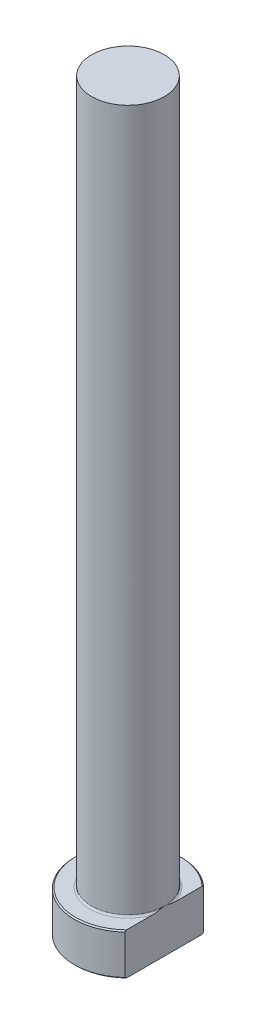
from build123d import *
from build123d.topology import SkipClean

# Parameters (mm, degrees)
CHAMFER1_SIZE = 0.2
FILLET1_R     = 0.3
KEY_DEPTH     = 126.646329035


with BuildPart() as part:
    # Sketch1 → Revolve1 (revolve)
    with BuildSketch(Plane.XY, mode=Mode.PRIVATE) as revolve1_sk:
        Polygon((0, 0), (-9, 0), (-9, 7), (-6.1, 7), (-6.1, 125), (0, 125), align=None)
    revolve(revolve1_sk.sketch.rotate(Axis((0, 259.958771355, 0), (0, -1, 0)), 270), axis=Axis((0, 259.958771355, 0), (0, -1, 0)))

    # Chamfer1
    chamfer1_edges = [part.edges().sort_by_distance(p)[0] for p in [
        (0, 7, -9),
        (0, 0, -9),
    ]]
    chamfer(chamfer1_edges, length=CHAMFER1_SIZE)

    # Fillet1
    fillet1_edges = [part.edges().sort_by_distance(p)[0] for p in [
        (0, 7, -6.1),
    ]]
    fillet(fillet1_edges, radius=FILLET1_R)

    # Sketch2 → KEY (cut, through all)
    with SkipClean():  # the faces are left unmerged after this step: merging them gives an invalid solid
        with BuildSketch(Plane(origin=(0, 0, 0), x_dir=(1, 0, 0), z_dir=(0, 1, 0))):
            with BuildLine():
                Line((6.1, 6.617401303), (6.1, -6.617401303))
                ThreePointArc((6.1, -6.617401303), (9, 0), (6.1, 6.617401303))
            make_face()
        extrude(amount=KEY_DEPTH, mode=Mode.SUBTRACT)


solid = part.part
